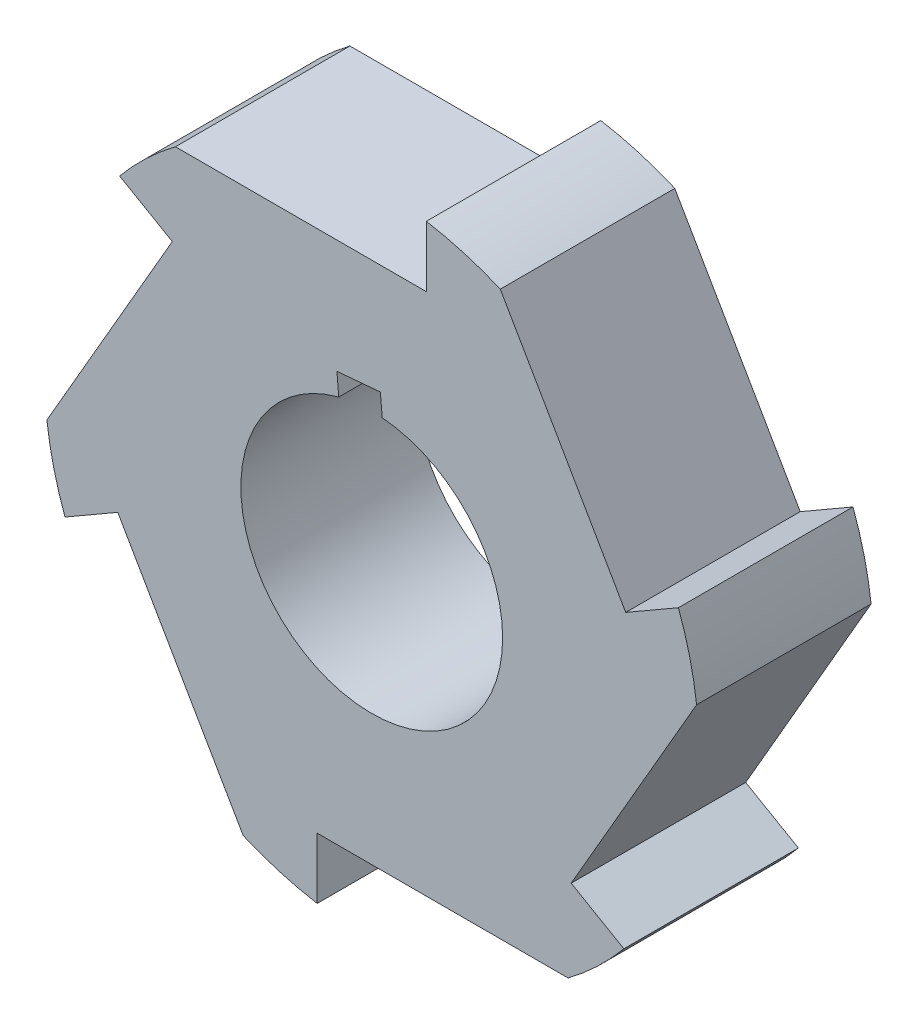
ISO-10303-21;
HEADER;
FILE_DESCRIPTION(('STEP AP214'),'2;1');
FILE_NAME('part.step','',(''),(''),'','','');
FILE_SCHEMA(('AUTOMOTIVE_DESIGN { 1 0 10303 214 1 1 1 1 }'));
ENDSEC;
DATA;
#1=APPLICATION_CONTEXT('core data for automotive mechanical design processes');
#2=APPLICATION_PROTOCOL_DEFINITION('international standard','automotive_design',2000,#1);
#3=PRODUCT_CONTEXT('',#1,'mechanical');
#4=PRODUCT('Part','Part','',(#3));
#5=PRODUCT_RELATED_PRODUCT_CATEGORY('part','',(#4));
#6=PRODUCT_DEFINITION_FORMATION('','',#4);
#7=PRODUCT_DEFINITION_CONTEXT('part definition',#1,'design');
#8=PRODUCT_DEFINITION('design','',#6,#7);
#9=PRODUCT_DEFINITION_SHAPE('','',#8);
#10=(LENGTH_UNIT() NAMED_UNIT(*) SI_UNIT(.MILLI.,.METRE.));
#11=(NAMED_UNIT(*) PLANE_ANGLE_UNIT() SI_UNIT($,.RADIAN.));
#12=(NAMED_UNIT(*) SI_UNIT($,.STERADIAN.) SOLID_ANGLE_UNIT());
#13=UNCERTAINTY_MEASURE_WITH_UNIT(LENGTH_MEASURE(1.E-05),#10,'distance_accuracy_value','');
#14=(GEOMETRIC_REPRESENTATION_CONTEXT(3) GLOBAL_UNCERTAINTY_ASSIGNED_CONTEXT((#13)) GLOBAL_UNIT_ASSIGNED_CONTEXT((#10,
#11,#12)) REPRESENTATION_CONTEXT('',''));
#15=CARTESIAN_POINT('',(0.,0.,0.));
#16=DIRECTION('',(0.,0.,1.));
#17=DIRECTION('',(1.,0.,0.));
#18=AXIS2_PLACEMENT_3D('',#15,#16,#17);
#19=CARTESIAN_POINT('',(0.,0.,7.99999999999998));
#20=DIRECTION('',(0.,0.,-1.));
#21=DIRECTION('',(-1.,0.,0.));
#22=AXIS2_PLACEMENT_3D('',#19,#20,#21);
#23=CYLINDRICAL_SURFACE('',#22,15.);
#24=CARTESIAN_POINT('',(0.,0.,0.));
#25=DIRECTION('',(0.,0.,1.));
#26=DIRECTION('',(1.,0.,0.));
#27=AXIS2_PLACEMENT_3D('',#24,#25,#26);
#28=CIRCLE('',#27,15.);
#29=CARTESIAN_POINT('',(-9.00000000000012,12.0000000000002,0.));
#30=VERTEX_POINT('',#29);
#31=CARTESIAN_POINT('',(-11.5586884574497,9.56016323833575,0.));
#32=VERTEX_POINT('',#31);
#33=EDGE_CURVE('E220',#30,#32,#28,.T.);
#34=ORIENTED_EDGE('',*,*,#33,.T.);
#35=DIRECTION('',(0.,0.,1.));
#36=VECTOR('',#35,1.);
#37=CARTESIAN_POINT('',(-11.5586884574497,9.56016323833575,0.));
#38=LINE('',#37,#36);
#39=CARTESIAN_POINT('',(-11.5586884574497,9.56016323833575,8.00000000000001));
#40=VERTEX_POINT('',#39);
#41=EDGE_CURVE('E359',#32,#40,#38,.T.);
#42=ORIENTED_EDGE('',*,*,#41,.T.);
#43=CARTESIAN_POINT('',(0.,0.,7.99999999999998));
#44=DIRECTION('',(0.,0.,1.));
#45=DIRECTION('',(1.,0.,0.));
#46=AXIS2_PLACEMENT_3D('',#43,#44,#45);
#47=CIRCLE('',#46,15.);
#48=CARTESIAN_POINT('',(-9.00000000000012,12.0000000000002,7.99999999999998));
#49=VERTEX_POINT('',#48);
#50=EDGE_CURVE('E11',#49,#40,#47,.T.);
#51=ORIENTED_EDGE('',*,*,#50,.F.);
#52=DIRECTION('',(0.,0.,1.));
#53=VECTOR('',#52,1.);
#54=CARTESIAN_POINT('',(-9.00000000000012,12.0000000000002,0.));
#55=LINE('',#54,#53);
#56=EDGE_CURVE('E276',#30,#49,#55,.T.);
#57=ORIENTED_EDGE('',*,*,#56,.F.);
#58=EDGE_LOOP('',(#34,#42,#51,#57));
#59=FACE_BOUND('',#58,.T.);
#60=ADVANCED_FACE('F32',(#59),#23,.T.);
#61=CARTESIAN_POINT('',(-14.8923048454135,-1.79422863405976,8.00000000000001));
#62=VERTEX_POINT('',#61);
#63=CARTESIAN_POINT('',(-14.0586884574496,-5.23003621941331,8.00000000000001));
#64=VERTEX_POINT('',#63);
#65=EDGE_CURVE('E40',#62,#64,#47,.T.);
#66=ORIENTED_EDGE('',*,*,#65,.F.);
#67=DIRECTION('',(0.,0.,1.));
#68=VECTOR('',#67,1.);
#69=CARTESIAN_POINT('',(-14.8923048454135,-1.79422863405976,0.));
#70=LINE('',#69,#68);
#71=CARTESIAN_POINT('',(-14.8923048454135,-1.79422863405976,0.));
#72=VERTEX_POINT('',#71);
#73=EDGE_CURVE('E183',#72,#62,#70,.T.);
#74=ORIENTED_EDGE('',*,*,#73,.F.);
#75=CARTESIAN_POINT('',(-14.0586884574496,-5.23003621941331,0.));
#76=VERTEX_POINT('',#75);
#77=EDGE_CURVE('E226',#72,#76,#28,.T.);
#78=ORIENTED_EDGE('',*,*,#77,.T.);
#79=DIRECTION('',(0.,0.,1.));
#80=VECTOR('',#79,1.);
#81=CARTESIAN_POINT('',(-14.0586884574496,-5.23003621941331,0.));
#82=LINE('',#81,#80);
#83=EDGE_CURVE('E204',#76,#64,#82,.T.);
#84=ORIENTED_EDGE('',*,*,#83,.T.);
#85=EDGE_LOOP('',(#66,#74,#78,#84));
#86=FACE_BOUND('',#85,.T.);
#87=ADVANCED_FACE('F203',(#86),#23,.T.);
#88=CARTESIAN_POINT('',(-5.89230484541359,-13.79422863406,8.00000000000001));
#89=VERTEX_POINT('',#88);
#90=CARTESIAN_POINT('',(-2.50000000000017,-14.7901994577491,8.00000000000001));
#91=VERTEX_POINT('',#90);
#92=EDGE_CURVE('E205',#89,#91,#47,.T.);
#93=ORIENTED_EDGE('',*,*,#92,.F.);
#94=DIRECTION('',(0.,0.,1.));
#95=VECTOR('',#94,1.);
#96=CARTESIAN_POINT('',(-5.89230484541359,-13.79422863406,0.));
#97=LINE('',#96,#95);
#98=CARTESIAN_POINT('',(-5.89230484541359,-13.79422863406,0.));
#99=VERTEX_POINT('',#98);
#100=EDGE_CURVE('E346',#99,#89,#97,.T.);
#101=ORIENTED_EDGE('',*,*,#100,.F.);
#102=CARTESIAN_POINT('',(-2.50000000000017,-14.7901994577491,0.));
#103=VERTEX_POINT('',#102);
#104=EDGE_CURVE('E232',#99,#103,#28,.T.);
#105=ORIENTED_EDGE('',*,*,#104,.T.);
#106=DIRECTION('',(0.,0.,1.));
#107=VECTOR('',#106,1.);
#108=CARTESIAN_POINT('',(-2.50000000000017,-14.7901994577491,0.));
#109=LINE('',#108,#107);
#110=EDGE_CURVE('E328',#103,#91,#109,.T.);
#111=ORIENTED_EDGE('',*,*,#110,.T.);
#112=EDGE_LOOP('',(#93,#101,#105,#111));
#113=FACE_BOUND('',#112,.T.);
#114=ADVANCED_FACE('F378',(#113),#23,.T.);
#115=CARTESIAN_POINT('',(8.99999999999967,-12.,7.99999999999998));
#116=VERTEX_POINT('',#115);
#117=CARTESIAN_POINT('',(11.5586884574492,-9.56016323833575,7.99999999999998));
#118=VERTEX_POINT('',#117);
#119=EDGE_CURVE('E206',#116,#118,#47,.T.);
#120=ORIENTED_EDGE('',*,*,#119,.F.);
#121=DIRECTION('',(0.,0.,1.));
#122=VECTOR('',#121,1.);
#123=CARTESIAN_POINT('',(8.99999999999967,-12.,0.));
#124=LINE('',#123,#122);
#125=CARTESIAN_POINT('',(8.99999999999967,-12.,0.));
#126=VERTEX_POINT('',#125);
#127=EDGE_CURVE('E329',#126,#116,#124,.T.);
#128=ORIENTED_EDGE('',*,*,#127,.F.);
#129=CARTESIAN_POINT('',(11.5586884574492,-9.56016323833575,0.));
#130=VERTEX_POINT('',#129);
#131=EDGE_CURVE('E241',#126,#130,#28,.T.);
#132=ORIENTED_EDGE('',*,*,#131,.T.);
#133=DIRECTION('',(0.,0.,1.));
#134=VECTOR('',#133,1.);
#135=CARTESIAN_POINT('',(11.5586884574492,-9.56016323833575,0.));
#136=LINE('',#135,#134);
#137=EDGE_CURVE('E310',#130,#118,#136,.T.);
#138=ORIENTED_EDGE('',*,*,#137,.T.);
#139=EDGE_LOOP('',(#120,#128,#132,#138));
#140=FACE_BOUND('',#139,.T.);
#141=ADVANCED_FACE('F389',(#140),#23,.T.);
#142=CARTESIAN_POINT('',(14.8923048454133,1.79422863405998,7.99999999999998));
#143=VERTEX_POINT('',#142);
#144=CARTESIAN_POINT('',(14.0586884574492,5.23003621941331,7.99999999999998));
#145=VERTEX_POINT('',#144);
#146=EDGE_CURVE('E211',#143,#145,#47,.T.);
#147=ORIENTED_EDGE('',*,*,#146,.F.);
#148=DIRECTION('',(0.,0.,1.));
#149=VECTOR('',#148,1.);
#150=CARTESIAN_POINT('',(14.8923048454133,1.79422863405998,0.));
#151=LINE('',#150,#149);
#152=CARTESIAN_POINT('',(14.8923048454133,1.79422863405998,0.));
#153=VERTEX_POINT('',#152);
#154=EDGE_CURVE('E311',#153,#143,#151,.T.);
#155=ORIENTED_EDGE('',*,*,#154,.F.);
#156=CARTESIAN_POINT('',(14.0586884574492,5.23003621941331,0.));
#157=VERTEX_POINT('',#156);
#158=EDGE_CURVE('E234',#153,#157,#28,.T.);
#159=ORIENTED_EDGE('',*,*,#158,.T.);
#160=DIRECTION('',(0.,0.,1.));
#161=VECTOR('',#160,1.);
#162=CARTESIAN_POINT('',(14.0586884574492,5.23003621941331,0.));
#163=LINE('',#162,#161);
#164=EDGE_CURVE('E292',#157,#145,#163,.T.);
#165=ORIENTED_EDGE('',*,*,#164,.T.);
#166=EDGE_LOOP('',(#147,#155,#159,#165));
#167=FACE_BOUND('',#166,.T.);
#168=ADVANCED_FACE('F399',(#167),#23,.T.);
#169=CARTESIAN_POINT('',(0.,0.,7.99999999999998));
#170=DIRECTION('',(0.,0.,1.));
#171=DIRECTION('',(1.,0.,0.));
#172=AXIS2_PLACEMENT_3D('',#169,#170,#171);
#173=PLANE('',#172);
#174=DIRECTION('',(-0.866025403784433,0.50000000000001,0.));
#175=VECTOR('',#174,1.);
#176=CARTESIAN_POINT('',(-9.14230484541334,8.16506350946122,8.00000000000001));
#177=LINE('',#176,#175);
#178=CARTESIAN_POINT('',(-9.14230484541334,8.16506350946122,8.00000000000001));
#179=VERTEX_POINT('',#178);
#180=EDGE_CURVE('E200',#179,#40,#177,.T.);
#181=ORIENTED_EDGE('',*,*,#180,.F.);
#182=DIRECTION('',(0.50000000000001,0.866025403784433,0.));
#183=VECTOR('',#182,1.);
#184=CARTESIAN_POINT('',(-14.8923048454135,-1.79422863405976,8.00000000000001));
#185=LINE('',#184,#183);
#186=EDGE_CURVE('E186',#62,#179,#185,.T.);
#187=ORIENTED_EDGE('',*,*,#186,.F.);
#188=ORIENTED_EDGE('',*,*,#65,.T.);
#189=DIRECTION('',(-0.866025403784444,-0.499999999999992,0.));
#190=VECTOR('',#189,1.);
#191=CARTESIAN_POINT('',(-11.6423048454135,-3.83493649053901,8.00000000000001));
#192=LINE('',#191,#190);
#193=CARTESIAN_POINT('',(-11.6423048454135,-3.83493649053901,8.00000000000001));
#194=VERTEX_POINT('',#193);
#195=EDGE_CURVE('E355',#194,#64,#192,.T.);
#196=ORIENTED_EDGE('',*,*,#195,.F.);
#197=DIRECTION('',(-0.499999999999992,0.866025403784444,0.));
#198=VECTOR('',#197,1.);
#199=CARTESIAN_POINT('',(-5.89230484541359,-13.79422863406,8.00000000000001));
#200=LINE('',#199,#198);
#201=EDGE_CURVE('E357',#89,#194,#200,.T.);
#202=ORIENTED_EDGE('',*,*,#201,.F.);
#203=ORIENTED_EDGE('',*,*,#92,.T.);
#204=DIRECTION('',(0.,-1.,0.));
#205=VECTOR('',#204,1.);
#206=CARTESIAN_POINT('',(-2.50000000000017,-12.,8.00000000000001));
#207=LINE('',#206,#205);
#208=CARTESIAN_POINT('',(-2.50000000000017,-12.,8.00000000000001));
#209=VERTEX_POINT('',#208);
#210=EDGE_CURVE('E341',#209,#91,#207,.T.);
#211=ORIENTED_EDGE('',*,*,#210,.F.);
#212=DIRECTION('',(-1.,0.,0.));
#213=VECTOR('',#212,1.);
#214=CARTESIAN_POINT('',(8.99999999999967,-12.,7.99999999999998));
#215=LINE('',#214,#213);
#216=EDGE_CURVE('E343',#116,#209,#215,.T.);
#217=ORIENTED_EDGE('',*,*,#216,.F.);
#218=ORIENTED_EDGE('',*,*,#119,.T.);
#219=DIRECTION('',(0.866025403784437,-0.500000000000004,0.));
#220=VECTOR('',#219,1.);
#221=CARTESIAN_POINT('',(9.14230484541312,-8.165063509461,7.99999999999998));
#222=LINE('',#221,#220);
#223=CARTESIAN_POINT('',(9.14230484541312,-8.165063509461,7.99999999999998));
#224=VERTEX_POINT('',#223);
#225=EDGE_CURVE('E323',#224,#118,#222,.T.);
#226=ORIENTED_EDGE('',*,*,#225,.F.);
#227=DIRECTION('',(-0.500000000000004,-0.866025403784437,0.));
#228=VECTOR('',#227,1.);
#229=CARTESIAN_POINT('',(14.8923048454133,1.79422863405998,7.99999999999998));
#230=LINE('',#229,#228);
#231=EDGE_CURVE('E325',#143,#224,#230,.T.);
#232=ORIENTED_EDGE('',*,*,#231,.F.);
#233=ORIENTED_EDGE('',*,*,#146,.T.);
#234=DIRECTION('',(0.86602540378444,0.499999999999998,0.));
#235=VECTOR('',#234,1.);
#236=CARTESIAN_POINT('',(11.6423048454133,3.83493649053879,7.99999999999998));
#237=LINE('',#236,#235);
#238=CARTESIAN_POINT('',(11.6423048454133,3.83493649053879,7.99999999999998));
#239=VERTEX_POINT('',#238);
#240=EDGE_CURVE('E305',#239,#145,#237,.T.);
#241=ORIENTED_EDGE('',*,*,#240,.F.);
#242=DIRECTION('',(0.499999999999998,-0.86602540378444,0.));
#243=VECTOR('',#242,1.);
#244=CARTESIAN_POINT('',(5.89230484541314,13.79422863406,7.99999999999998));
#245=LINE('',#244,#243);
#246=CARTESIAN_POINT('',(5.89230484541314,13.79422863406,7.99999999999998));
#247=VERTEX_POINT('',#246);
#248=EDGE_CURVE('E307',#247,#239,#245,.T.);
#249=ORIENTED_EDGE('',*,*,#248,.F.);
#250=CARTESIAN_POINT('',(2.49999999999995,14.7901994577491,7.99999999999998));
#251=VERTEX_POINT('',#250);
#252=EDGE_CURVE('E41',#247,#251,#47,.T.);
#253=ORIENTED_EDGE('',*,*,#252,.T.);
#254=DIRECTION('',(0.,1.,0.));
#255=VECTOR('',#254,1.);
#256=CARTESIAN_POINT('',(2.49999999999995,12.,7.99999999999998));
#257=LINE('',#256,#255);
#258=CARTESIAN_POINT('',(2.49999999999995,12.,7.99999999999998));
#259=VERTEX_POINT('',#258);
#260=EDGE_CURVE('E287',#259,#251,#257,.T.);
#261=ORIENTED_EDGE('',*,*,#260,.F.);
#262=DIRECTION('',(1.,0.,0.));
#263=VECTOR('',#262,1.);
#264=CARTESIAN_POINT('',(-9.00000000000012,12.0000000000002,7.99999999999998));
#265=LINE('',#264,#263);
#266=EDGE_CURVE('E289',#49,#259,#265,.T.);
#267=ORIENTED_EDGE('',*,*,#266,.F.);
#268=ORIENTED_EDGE('',*,*,#50,.T.);
#269=EDGE_LOOP('',(#181,#187,#188,#196,#202,#203,#211,#217,#218,#226,#232,#233,#241,#249,#253,
#261,#267,#268));
#270=FACE_BOUND('',#269,.T.);
#271=DIRECTION('',(-0.0871557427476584,0.996194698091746,0.));
#272=VECTOR('',#271,1.);
#273=CARTESIAN_POINT('',(0.480574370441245,5.98072305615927,7.99999999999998));
#274=LINE('',#273,#272);
#275=CARTESIAN_POINT('',(0.480574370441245,5.98072305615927,7.99999999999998));
#276=VERTEX_POINT('',#275);
#277=CARTESIAN_POINT('',(0.39482007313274,6.96089915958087,7.99999999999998));
#278=VERTEX_POINT('',#277);
#279=EDGE_CURVE('E260',#276,#278,#274,.T.);
#280=ORIENTED_EDGE('',*,*,#279,.F.);
#281=CARTESIAN_POINT('',(0.,0.,7.99999999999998));
#282=DIRECTION('',(0.,0.,1.));
#283=DIRECTION('',(1.,0.,0.));
#284=AXIS2_PLACEMENT_3D('',#281,#282,#283);
#285=CIRCLE('',#284,6.);
#286=CARTESIAN_POINT('',(-1.51181502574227,5.80641157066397,7.99999999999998));
#287=VERTEX_POINT('',#286);
#288=EDGE_CURVE('E262',#287,#276,#285,.T.);
#289=ORIENTED_EDGE('',*,*,#288,.F.);
#290=DIRECTION('',(-0.0871557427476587,0.996194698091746,0.));
#291=VECTOR('',#290,1.);
#292=CARTESIAN_POINT('',(-1.51181502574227,5.80641157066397,7.99999999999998));
#293=LINE('',#292,#291);
#294=CARTESIAN_POINT('',(-1.59756932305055,6.78658767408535,7.99999999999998));
#295=VERTEX_POINT('',#294);
#296=EDGE_CURVE('E254',#287,#295,#293,.T.);
#297=ORIENTED_EDGE('',*,*,#296,.T.);
#298=DIRECTION('',(-0.996194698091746,-0.0871557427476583,0.));
#299=VECTOR('',#298,1.);
#300=CARTESIAN_POINT('',(0.39482007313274,6.96089915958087,7.99999999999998));
#301=LINE('',#300,#299);
#302=EDGE_CURVE('E257',#278,#295,#301,.T.);
#303=ORIENTED_EDGE('',*,*,#302,.F.);
#304=EDGE_LOOP('',(#280,#289,#297,#303));
#305=FACE_BOUND('',#304,.T.);
#306=ADVANCED_FACE('F196',(#270,#305),#173,.T.);
#307=CARTESIAN_POINT('',(0.,0.,0.));
#308=DIRECTION('',(0.,0.,1.));
#309=DIRECTION('',(1.,0.,0.));
#310=AXIS2_PLACEMENT_3D('',#307,#308,#309);
#311=PLANE('',#310);
#312=DIRECTION('',(0.50000000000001,0.866025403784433,0.));
#313=VECTOR('',#312,1.);
#314=CARTESIAN_POINT('',(-14.8923048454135,-1.79422863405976,0.));
#315=LINE('',#314,#313);
#316=CARTESIAN_POINT('',(-9.14230484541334,8.16506350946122,0.));
#317=VERTEX_POINT('',#316);
#318=EDGE_CURVE('E189',#72,#317,#315,.T.);
#319=ORIENTED_EDGE('',*,*,#318,.T.);
#320=DIRECTION('',(-0.866025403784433,0.50000000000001,0.));
#321=VECTOR('',#320,1.);
#322=CARTESIAN_POINT('',(-9.14230484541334,8.16506350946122,0.));
#323=LINE('',#322,#321);
#324=EDGE_CURVE('E48',#317,#32,#323,.T.);
#325=ORIENTED_EDGE('',*,*,#324,.T.);
#326=ORIENTED_EDGE('',*,*,#33,.F.);
#327=DIRECTION('',(1.,0.,0.));
#328=VECTOR('',#327,1.);
#329=CARTESIAN_POINT('',(-9.00000000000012,12.0000000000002,0.));
#330=LINE('',#329,#328);
#331=CARTESIAN_POINT('',(2.49999999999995,12.,0.));
#332=VERTEX_POINT('',#331);
#333=EDGE_CURVE('E284',#30,#332,#330,.T.);
#334=ORIENTED_EDGE('',*,*,#333,.T.);
#335=DIRECTION('',(0.,1.,0.));
#336=VECTOR('',#335,1.);
#337=CARTESIAN_POINT('',(2.49999999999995,12.,0.));
#338=LINE('',#337,#336);
#339=CARTESIAN_POINT('',(2.49999999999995,14.7901994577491,0.));
#340=VERTEX_POINT('',#339);
#341=EDGE_CURVE('E279',#332,#340,#338,.T.);
#342=ORIENTED_EDGE('',*,*,#341,.T.);
#343=CARTESIAN_POINT('',(5.89230484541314,13.79422863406,0.));
#344=VERTEX_POINT('',#343);
#345=EDGE_CURVE('E227',#344,#340,#28,.T.);
#346=ORIENTED_EDGE('',*,*,#345,.F.);
#347=DIRECTION('',(0.499999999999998,-0.86602540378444,0.));
#348=VECTOR('',#347,1.);
#349=CARTESIAN_POINT('',(5.89230484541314,13.79422863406,0.));
#350=LINE('',#349,#348);
#351=CARTESIAN_POINT('',(11.6423048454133,3.83493649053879,0.));
#352=VERTEX_POINT('',#351);
#353=EDGE_CURVE('E302',#344,#352,#350,.T.);
#354=ORIENTED_EDGE('',*,*,#353,.T.);
#355=DIRECTION('',(0.86602540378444,0.499999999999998,0.));
#356=VECTOR('',#355,1.);
#357=CARTESIAN_POINT('',(11.6423048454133,3.83493649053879,0.));
#358=LINE('',#357,#356);
#359=EDGE_CURVE('E296',#352,#157,#358,.T.);
#360=ORIENTED_EDGE('',*,*,#359,.T.);
#361=ORIENTED_EDGE('',*,*,#158,.F.);
#362=DIRECTION('',(-0.500000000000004,-0.866025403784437,0.));
#363=VECTOR('',#362,1.);
#364=CARTESIAN_POINT('',(14.8923048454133,1.79422863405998,0.));
#365=LINE('',#364,#363);
#366=CARTESIAN_POINT('',(9.14230484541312,-8.165063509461,0.));
#367=VERTEX_POINT('',#366);
#368=EDGE_CURVE('E320',#153,#367,#365,.T.);
#369=ORIENTED_EDGE('',*,*,#368,.T.);
#370=DIRECTION('',(0.866025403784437,-0.500000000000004,0.));
#371=VECTOR('',#370,1.);
#372=CARTESIAN_POINT('',(9.14230484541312,-8.165063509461,0.));
#373=LINE('',#372,#371);
#374=EDGE_CURVE('E314',#367,#130,#373,.T.);
#375=ORIENTED_EDGE('',*,*,#374,.T.);
#376=ORIENTED_EDGE('',*,*,#131,.F.);
#377=DIRECTION('',(-1.,0.,0.));
#378=VECTOR('',#377,1.);
#379=CARTESIAN_POINT('',(8.99999999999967,-12.,0.));
#380=LINE('',#379,#378);
#381=CARTESIAN_POINT('',(-2.50000000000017,-12.,0.));
#382=VERTEX_POINT('',#381);
#383=EDGE_CURVE('E338',#126,#382,#380,.T.);
#384=ORIENTED_EDGE('',*,*,#383,.T.);
#385=DIRECTION('',(0.,-1.,0.));
#386=VECTOR('',#385,1.);
#387=CARTESIAN_POINT('',(-2.50000000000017,-12.,0.));
#388=LINE('',#387,#386);
#389=EDGE_CURVE('E332',#382,#103,#388,.T.);
#390=ORIENTED_EDGE('',*,*,#389,.T.);
#391=ORIENTED_EDGE('',*,*,#104,.F.);
#392=DIRECTION('',(-0.499999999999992,0.866025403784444,0.));
#393=VECTOR('',#392,1.);
#394=CARTESIAN_POINT('',(-5.89230484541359,-13.79422863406,0.));
#395=LINE('',#394,#393);
#396=CARTESIAN_POINT('',(-11.6423048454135,-3.83493649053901,0.));
#397=VERTEX_POINT('',#396);
#398=EDGE_CURVE('E352',#99,#397,#395,.T.);
#399=ORIENTED_EDGE('',*,*,#398,.T.);
#400=DIRECTION('',(-0.866025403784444,-0.499999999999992,0.));
#401=VECTOR('',#400,1.);
#402=CARTESIAN_POINT('',(-11.6423048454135,-3.83493649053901,0.));
#403=LINE('',#402,#401);
#404=EDGE_CURVE('E56',#397,#76,#403,.T.);
#405=ORIENTED_EDGE('',*,*,#404,.T.);
#406=ORIENTED_EDGE('',*,*,#77,.F.);
#407=EDGE_LOOP('',(#319,#325,#326,#334,#342,#346,#354,#360,#361,#369,#375,#376,#384,#390,#391,
#399,#405,#406));
#408=FACE_BOUND('',#407,.T.);
#409=CARTESIAN_POINT('',(0.,0.,0.));
#410=DIRECTION('',(0.,0.,1.));
#411=DIRECTION('',(1.,0.,0.));
#412=AXIS2_PLACEMENT_3D('',#409,#410,#411);
#413=CIRCLE('',#412,6.);
#414=CARTESIAN_POINT('',(-1.51181502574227,5.80641157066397,0.));
#415=VERTEX_POINT('',#414);
#416=CARTESIAN_POINT('',(0.480574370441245,5.98072305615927,0.));
#417=VERTEX_POINT('',#416);
#418=EDGE_CURVE('E273',#415,#417,#413,.T.);
#419=ORIENTED_EDGE('',*,*,#418,.T.);
#420=DIRECTION('',(-0.0871557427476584,0.996194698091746,0.));
#421=VECTOR('',#420,1.);
#422=CARTESIAN_POINT('',(0.480574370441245,5.98072305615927,0.));
#423=LINE('',#422,#421);
#424=CARTESIAN_POINT('',(0.39482007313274,6.96089915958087,0.));
#425=VERTEX_POINT('',#424);
#426=EDGE_CURVE('E270',#417,#425,#423,.T.);
#427=ORIENTED_EDGE('',*,*,#426,.T.);
#428=DIRECTION('',(-0.996194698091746,-0.0871557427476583,0.));
#429=VECTOR('',#428,1.);
#430=CARTESIAN_POINT('',(0.39482007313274,6.96089915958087,0.));
#431=LINE('',#430,#429);
#432=CARTESIAN_POINT('',(-1.59756932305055,6.78658767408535,0.));
#433=VERTEX_POINT('',#432);
#434=EDGE_CURVE('E267',#425,#433,#431,.T.);
#435=ORIENTED_EDGE('',*,*,#434,.T.);
#436=DIRECTION('',(-0.0871557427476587,0.996194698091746,0.));
#437=VECTOR('',#436,1.);
#438=CARTESIAN_POINT('',(-1.51181502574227,5.80641157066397,0.));
#439=LINE('',#438,#437);
#440=EDGE_CURVE('E264',#415,#433,#439,.T.);
#441=ORIENTED_EDGE('',*,*,#440,.F.);
#442=EDGE_LOOP('',(#419,#427,#435,#441));
#443=FACE_BOUND('',#442,.T.);
#444=ADVANCED_FACE('F372',(#408,#443),#311,.F.);
#445=ORIENTED_EDGE('',*,*,#252,.F.);
#446=DIRECTION('',(0.,0.,1.));
#447=VECTOR('',#446,1.);
#448=CARTESIAN_POINT('',(5.89230484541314,13.79422863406,0.));
#449=LINE('',#448,#447);
#450=EDGE_CURVE('E293',#344,#247,#449,.T.);
#451=ORIENTED_EDGE('',*,*,#450,.F.);
#452=ORIENTED_EDGE('',*,*,#345,.T.);
#453=DIRECTION('',(0.,0.,1.));
#454=VECTOR('',#453,1.);
#455=CARTESIAN_POINT('',(2.49999999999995,14.7901994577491,0.));
#456=LINE('',#455,#454);
#457=EDGE_CURVE('E275',#340,#251,#456,.T.);
#458=ORIENTED_EDGE('',*,*,#457,.T.);
#459=EDGE_LOOP('',(#445,#451,#452,#458));
#460=FACE_BOUND('',#459,.T.);
#461=ADVANCED_FACE('F34',(#460),#23,.T.);
#462=CARTESIAN_POINT('',(0.,0.,7.99999999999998));
#463=DIRECTION('',(0.,0.,-1.));
#464=DIRECTION('',(-1.,0.,0.));
#465=AXIS2_PLACEMENT_3D('',#462,#463,#464);
#466=CYLINDRICAL_SURFACE('',#465,6.);
#467=ORIENTED_EDGE('',*,*,#418,.F.);
#468=DIRECTION('',(0.,0.,-1.));
#469=VECTOR('',#468,1.);
#470=CARTESIAN_POINT('',(-1.51181502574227,5.80641157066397,7.99999999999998));
#471=LINE('',#470,#469);
#472=EDGE_CURVE('E251',#287,#415,#471,.T.);
#473=ORIENTED_EDGE('',*,*,#472,.F.);
#474=ORIENTED_EDGE('',*,*,#288,.T.);
#475=DIRECTION('',(0.,0.,-1.));
#476=VECTOR('',#475,1.);
#477=CARTESIAN_POINT('',(0.480574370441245,5.98072305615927,7.99999999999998));
#478=LINE('',#477,#476);
#479=EDGE_CURVE('E235',#276,#417,#478,.T.);
#480=ORIENTED_EDGE('',*,*,#479,.T.);
#481=EDGE_LOOP('',(#467,#473,#474,#480));
#482=FACE_BOUND('',#481,.T.);
#483=ADVANCED_FACE('F425',(#482),#466,.F.);
#484=CARTESIAN_POINT('',(0.480574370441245,5.98072305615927,7.99999999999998));
#485=DIRECTION('',(-0.996194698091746,-0.0871557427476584,0.));
#486=DIRECTION('',(0.0871557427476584,-0.996194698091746,0.));
#487=AXIS2_PLACEMENT_3D('',#484,#485,#486);
#488=PLANE('',#487);
#489=ORIENTED_EDGE('',*,*,#426,.F.);
#490=ORIENTED_EDGE('',*,*,#479,.F.);
#491=ORIENTED_EDGE('',*,*,#279,.T.);
#492=DIRECTION('',(0.,0.,-1.));
#493=VECTOR('',#492,1.);
#494=CARTESIAN_POINT('',(0.39482007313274,6.96089915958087,7.99999999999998));
#495=LINE('',#494,#493);
#496=EDGE_CURVE('E243',#278,#425,#495,.T.);
#497=ORIENTED_EDGE('',*,*,#496,.T.);
#498=EDGE_LOOP('',(#489,#490,#491,#497));
#499=FACE_BOUND('',#498,.T.);
#500=ADVANCED_FACE('F430',(#499),#488,.T.);
#501=CARTESIAN_POINT('',(0.39482007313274,6.96089915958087,7.99999999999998));
#502=DIRECTION('',(0.0871557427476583,-0.996194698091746,0.));
#503=DIRECTION('',(0.996194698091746,0.0871557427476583,0.));
#504=AXIS2_PLACEMENT_3D('',#501,#502,#503);
#505=PLANE('',#504);
#506=ORIENTED_EDGE('',*,*,#434,.F.);
#507=ORIENTED_EDGE('',*,*,#496,.F.);
#508=ORIENTED_EDGE('',*,*,#302,.T.);
#509=DIRECTION('',(0.,0.,-1.));
#510=VECTOR('',#509,1.);
#511=CARTESIAN_POINT('',(-1.59756932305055,6.78658767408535,7.99999999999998));
#512=LINE('',#511,#510);
#513=EDGE_CURVE('E247',#295,#433,#512,.T.);
#514=ORIENTED_EDGE('',*,*,#513,.T.);
#515=EDGE_LOOP('',(#506,#507,#508,#514));
#516=FACE_BOUND('',#515,.T.);
#517=ADVANCED_FACE('F416',(#516),#505,.T.);
#518=CARTESIAN_POINT('',(-1.51181502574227,5.80641157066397,7.99999999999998));
#519=DIRECTION('',(-0.996194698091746,-0.0871557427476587,0.));
#520=DIRECTION('',(0.0871557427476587,-0.996194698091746,0.));
#521=AXIS2_PLACEMENT_3D('',#518,#519,#520);
#522=PLANE('',#521);
#523=ORIENTED_EDGE('',*,*,#440,.T.);
#524=ORIENTED_EDGE('',*,*,#513,.F.);
#525=ORIENTED_EDGE('',*,*,#296,.F.);
#526=ORIENTED_EDGE('',*,*,#472,.T.);
#527=EDGE_LOOP('',(#523,#524,#525,#526));
#528=FACE_BOUND('',#527,.T.);
#529=ADVANCED_FACE('F409',(#528),#522,.F.);
#530=CARTESIAN_POINT('',(2.49999999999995,12.,0.));
#531=DIRECTION('',(1.,0.,0.));
#532=DIRECTION('',(0.,0.,-1.));
#533=AXIS2_PLACEMENT_3D('',#530,#531,#532);
#534=PLANE('',#533);
#535=ORIENTED_EDGE('',*,*,#260,.T.);
#536=ORIENTED_EDGE('',*,*,#457,.F.);
#537=ORIENTED_EDGE('',*,*,#341,.F.);
#538=DIRECTION('',(0.,0.,1.));
#539=VECTOR('',#538,1.);
#540=CARTESIAN_POINT('',(2.49999999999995,12.,0.));
#541=LINE('',#540,#539);
#542=EDGE_CURVE('E278',#332,#259,#541,.T.);
#543=ORIENTED_EDGE('',*,*,#542,.T.);
#544=EDGE_LOOP('',(#535,#536,#537,#543));
#545=FACE_BOUND('',#544,.T.);
#546=ADVANCED_FACE('F407',(#545),#534,.F.);
#547=CARTESIAN_POINT('',(-9.00000000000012,12.0000000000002,0.));
#548=DIRECTION('',(0.,-1.,0.));
#549=DIRECTION('',(0.,0.,-1.));
#550=AXIS2_PLACEMENT_3D('',#547,#548,#549);
#551=PLANE('',#550);
#552=ORIENTED_EDGE('',*,*,#266,.T.);
#553=ORIENTED_EDGE('',*,*,#542,.F.);
#554=ORIENTED_EDGE('',*,*,#333,.F.);
#555=ORIENTED_EDGE('',*,*,#56,.T.);
#556=EDGE_LOOP('',(#552,#553,#554,#555));
#557=FACE_BOUND('',#556,.T.);
#558=ADVANCED_FACE('F369',(#557),#551,.F.);
#559=CARTESIAN_POINT('',(11.6423048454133,3.83493649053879,0.));
#560=DIRECTION('',(0.499999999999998,-0.86602540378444,0.));
#561=DIRECTION('',(0.86602540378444,0.499999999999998,0.));
#562=AXIS2_PLACEMENT_3D('',#559,#560,#561);
#563=PLANE('',#562);
#564=ORIENTED_EDGE('',*,*,#240,.T.);
#565=ORIENTED_EDGE('',*,*,#164,.F.);
#566=ORIENTED_EDGE('',*,*,#359,.F.);
#567=DIRECTION('',(0.,0.,1.));
#568=VECTOR('',#567,1.);
#569=CARTESIAN_POINT('',(11.6423048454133,3.83493649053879,0.));
#570=LINE('',#569,#568);
#571=EDGE_CURVE('E295',#352,#239,#570,.T.);
#572=ORIENTED_EDGE('',*,*,#571,.T.);
#573=EDGE_LOOP('',(#564,#565,#566,#572));
#574=FACE_BOUND('',#573,.T.);
#575=ADVANCED_FACE('F403',(#574),#563,.F.);
#576=CARTESIAN_POINT('',(5.89230484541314,13.79422863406,0.));
#577=DIRECTION('',(-0.86602540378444,-0.499999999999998,0.));
#578=DIRECTION('',(0.499999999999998,-0.86602540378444,0.));
#579=AXIS2_PLACEMENT_3D('',#576,#577,#578);
#580=PLANE('',#579);
#581=ORIENTED_EDGE('',*,*,#248,.T.);
#582=ORIENTED_EDGE('',*,*,#571,.F.);
#583=ORIENTED_EDGE('',*,*,#353,.F.);
#584=ORIENTED_EDGE('',*,*,#450,.T.);
#585=EDGE_LOOP('',(#581,#582,#583,#584));
#586=FACE_BOUND('',#585,.T.);
#587=ADVANCED_FACE('F405',(#586),#580,.F.);
#588=CARTESIAN_POINT('',(9.14230484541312,-8.165063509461,0.));
#589=DIRECTION('',(-0.500000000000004,-0.866025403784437,0.));
#590=DIRECTION('',(0.866025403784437,-0.500000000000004,0.));
#591=AXIS2_PLACEMENT_3D('',#588,#589,#590);
#592=PLANE('',#591);
#593=ORIENTED_EDGE('',*,*,#225,.T.);
#594=ORIENTED_EDGE('',*,*,#137,.F.);
#595=ORIENTED_EDGE('',*,*,#374,.F.);
#596=DIRECTION('',(0.,0.,1.));
#597=VECTOR('',#596,1.);
#598=CARTESIAN_POINT('',(9.14230484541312,-8.165063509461,0.));
#599=LINE('',#598,#597);
#600=EDGE_CURVE('E313',#367,#224,#599,.T.);
#601=ORIENTED_EDGE('',*,*,#600,.T.);
#602=EDGE_LOOP('',(#593,#594,#595,#601));
#603=FACE_BOUND('',#602,.T.);
#604=ADVANCED_FACE('F392',(#603),#592,.F.);
#605=CARTESIAN_POINT('',(14.8923048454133,1.79422863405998,0.));
#606=DIRECTION('',(-0.866025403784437,0.500000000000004,0.));
#607=DIRECTION('',(-0.500000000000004,-0.866025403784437,0.));
#608=AXIS2_PLACEMENT_3D('',#605,#606,#607);
#609=PLANE('',#608);
#610=ORIENTED_EDGE('',*,*,#231,.T.);
#611=ORIENTED_EDGE('',*,*,#600,.F.);
#612=ORIENTED_EDGE('',*,*,#368,.F.);
#613=ORIENTED_EDGE('',*,*,#154,.T.);
#614=EDGE_LOOP('',(#610,#611,#612,#613));
#615=FACE_BOUND('',#614,.T.);
#616=ADVANCED_FACE('F397',(#615),#609,.F.);
#617=CARTESIAN_POINT('',(-2.50000000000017,-12.,0.));
#618=DIRECTION('',(-1.,0.,0.));
#619=DIRECTION('',(0.,-1.,0.));
#620=AXIS2_PLACEMENT_3D('',#617,#618,#619);
#621=PLANE('',#620);
#622=ORIENTED_EDGE('',*,*,#210,.T.);
#623=ORIENTED_EDGE('',*,*,#110,.F.);
#624=ORIENTED_EDGE('',*,*,#389,.F.);
#625=DIRECTION('',(0.,0.,1.));
#626=VECTOR('',#625,1.);
#627=CARTESIAN_POINT('',(-2.50000000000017,-12.,0.));
#628=LINE('',#627,#626);
#629=EDGE_CURVE('E331',#382,#209,#628,.T.);
#630=ORIENTED_EDGE('',*,*,#629,.T.);
#631=EDGE_LOOP('',(#622,#623,#624,#630));
#632=FACE_BOUND('',#631,.T.);
#633=ADVANCED_FACE('F382',(#632),#621,.F.);
#634=CARTESIAN_POINT('',(8.99999999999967,-12.,0.));
#635=DIRECTION('',(0.,1.,0.));
#636=DIRECTION('',(-1.,0.,0.));
#637=AXIS2_PLACEMENT_3D('',#634,#635,#636);
#638=PLANE('',#637);
#639=ORIENTED_EDGE('',*,*,#216,.T.);
#640=ORIENTED_EDGE('',*,*,#629,.F.);
#641=ORIENTED_EDGE('',*,*,#383,.F.);
#642=ORIENTED_EDGE('',*,*,#127,.T.);
#643=EDGE_LOOP('',(#639,#640,#641,#642));
#644=FACE_BOUND('',#643,.T.);
#645=ADVANCED_FACE('F387',(#644),#638,.F.);
#646=CARTESIAN_POINT('',(-11.6423048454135,-3.83493649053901,0.));
#647=DIRECTION('',(-0.499999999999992,0.866025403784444,0.));
#648=DIRECTION('',(-0.866025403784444,-0.499999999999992,0.));
#649=AXIS2_PLACEMENT_3D('',#646,#647,#648);
#650=PLANE('',#649);
#651=ORIENTED_EDGE('',*,*,#195,.T.);
#652=ORIENTED_EDGE('',*,*,#83,.F.);
#653=ORIENTED_EDGE('',*,*,#404,.F.);
#654=DIRECTION('',(0.,0.,1.));
#655=VECTOR('',#654,1.);
#656=CARTESIAN_POINT('',(-11.6423048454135,-3.83493649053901,0.));
#657=LINE('',#656,#655);
#658=EDGE_CURVE('E348',#397,#194,#657,.T.);
#659=ORIENTED_EDGE('',*,*,#658,.T.);
#660=EDGE_LOOP('',(#651,#652,#653,#659));
#661=FACE_BOUND('',#660,.T.);
#662=ADVANCED_FACE('F374',(#661),#650,.F.);
#663=CARTESIAN_POINT('',(-5.89230484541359,-13.79422863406,0.));
#664=DIRECTION('',(0.866025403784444,0.499999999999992,0.));
#665=DIRECTION('',(-0.499999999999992,0.866025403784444,0.));
#666=AXIS2_PLACEMENT_3D('',#663,#664,#665);
#667=PLANE('',#666);
#668=ORIENTED_EDGE('',*,*,#201,.T.);
#669=ORIENTED_EDGE('',*,*,#658,.F.);
#670=ORIENTED_EDGE('',*,*,#398,.F.);
#671=ORIENTED_EDGE('',*,*,#100,.T.);
#672=EDGE_LOOP('',(#668,#669,#670,#671));
#673=FACE_BOUND('',#672,.T.);
#674=ADVANCED_FACE('F503',(#673),#667,.F.);
#675=CARTESIAN_POINT('',(-9.14230484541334,8.16506350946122,0.));
#676=DIRECTION('',(0.50000000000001,0.866025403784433,0.));
#677=DIRECTION('',(-0.866025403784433,0.50000000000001,0.));
#678=AXIS2_PLACEMENT_3D('',#675,#676,#677);
#679=PLANE('',#678);
#680=ORIENTED_EDGE('',*,*,#180,.T.);
#681=ORIENTED_EDGE('',*,*,#41,.F.);
#682=ORIENTED_EDGE('',*,*,#324,.F.);
#683=DIRECTION('',(0.,0.,1.));
#684=VECTOR('',#683,1.);
#685=CARTESIAN_POINT('',(-9.14230484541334,8.16506350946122,0.));
#686=LINE('',#685,#684);
#687=EDGE_CURVE('E193',#317,#179,#686,.T.);
#688=ORIENTED_EDGE('',*,*,#687,.T.);
#689=EDGE_LOOP('',(#680,#681,#682,#688));
#690=FACE_BOUND('',#689,.T.);
#691=ADVANCED_FACE('F365',(#690),#679,.F.);
#692=CARTESIAN_POINT('',(-14.8923048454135,-1.79422863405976,0.));
#693=DIRECTION('',(0.866025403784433,-0.50000000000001,0.));
#694=DIRECTION('',(0.50000000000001,0.866025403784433,0.));
#695=AXIS2_PLACEMENT_3D('',#692,#693,#694);
#696=PLANE('',#695);
#697=ORIENTED_EDGE('',*,*,#186,.T.);
#698=ORIENTED_EDGE('',*,*,#687,.F.);
#699=ORIENTED_EDGE('',*,*,#318,.F.);
#700=ORIENTED_EDGE('',*,*,#73,.T.);
#701=EDGE_LOOP('',(#697,#698,#699,#700));
#702=FACE_BOUND('',#701,.T.);
#703=ADVANCED_FACE('F185',(#702),#696,.F.);
#704=CLOSED_SHELL('',(#60,#87,#114,#141,#168,#306,#444,#461,#483,#500,#517,#529,#546,#558,#575,
#587,#604,#616,#633,#645,#662,#674,#691,#703));
#705=MANIFOLD_SOLID_BREP('B2',#704);
#706=ADVANCED_BREP_SHAPE_REPRESENTATION('',(#18,#705),#14);
#707=SHAPE_DEFINITION_REPRESENTATION(#9,#706);
ENDSEC;
END-ISO-10303-21;
